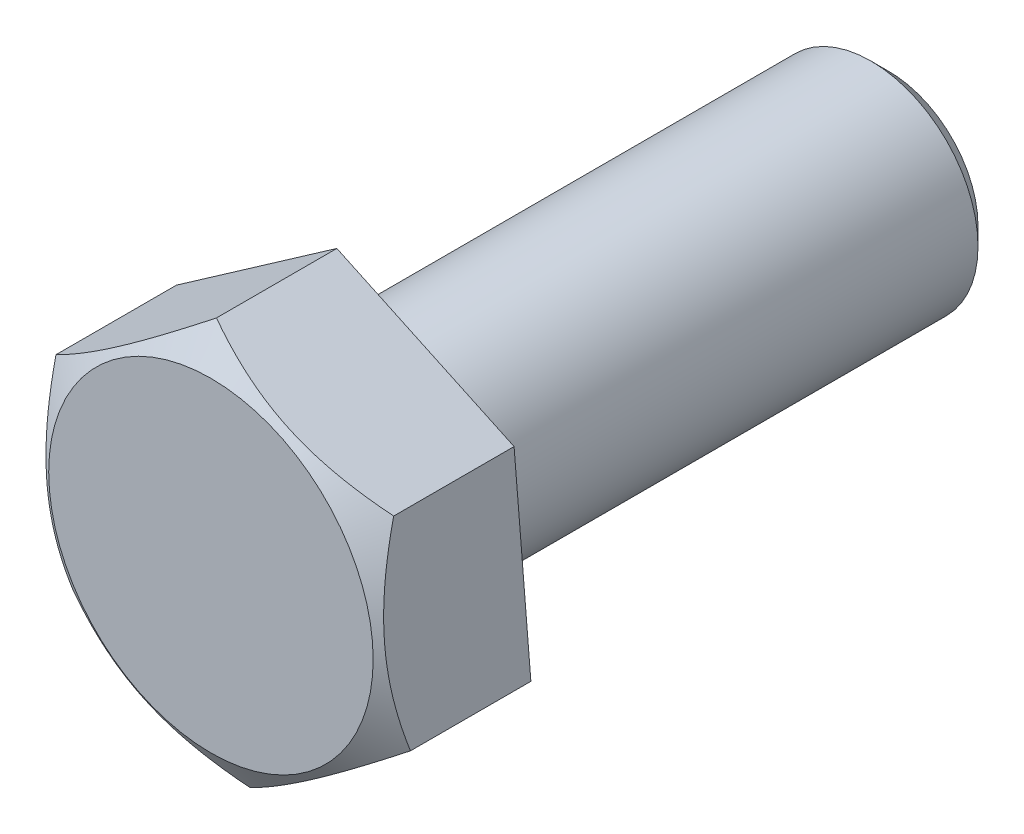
ISO-10303-21;
HEADER;
FILE_DESCRIPTION(('STEP AP214'),'2;1');
FILE_NAME('part.step','',(''),(''),'','','');
FILE_SCHEMA(('AUTOMOTIVE_DESIGN { 1 0 10303 214 1 1 1 1 }'));
ENDSEC;
DATA;
#1=APPLICATION_CONTEXT('core data for automotive mechanical design processes');
#2=APPLICATION_PROTOCOL_DEFINITION('international standard','automotive_design',2000,#1);
#3=PRODUCT_CONTEXT('',#1,'mechanical');
#4=PRODUCT('Part','Part','',(#3));
#5=PRODUCT_RELATED_PRODUCT_CATEGORY('part','',(#4));
#6=PRODUCT_DEFINITION_FORMATION('','',#4);
#7=PRODUCT_DEFINITION_CONTEXT('part definition',#1,'design');
#8=PRODUCT_DEFINITION('design','',#6,#7);
#9=PRODUCT_DEFINITION_SHAPE('','',#8);
#10=(LENGTH_UNIT() NAMED_UNIT(*) SI_UNIT(.MILLI.,.METRE.));
#11=(NAMED_UNIT(*) PLANE_ANGLE_UNIT() SI_UNIT($,.RADIAN.));
#12=(NAMED_UNIT(*) SI_UNIT($,.STERADIAN.) SOLID_ANGLE_UNIT());
#13=UNCERTAINTY_MEASURE_WITH_UNIT(LENGTH_MEASURE(1.E-05),#10,'distance_accuracy_value','');
#14=(GEOMETRIC_REPRESENTATION_CONTEXT(3) GLOBAL_UNCERTAINTY_ASSIGNED_CONTEXT((#13)) GLOBAL_UNIT_ASSIGNED_CONTEXT((#10,
#11,#12)) REPRESENTATION_CONTEXT('',''));
#15=CARTESIAN_POINT('',(0.,0.,0.));
#16=DIRECTION('',(0.,0.,1.));
#17=DIRECTION('',(1.,0.,0.));
#18=AXIS2_PLACEMENT_3D('',#15,#16,#17);
#19=CARTESIAN_POINT('',(-10.123708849,-10.123708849,9.491768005));
#20=DIRECTION('',(0.,0.,1.));
#21=DIRECTION('',(1.,0.,0.));
#22=AXIS2_PLACEMENT_3D('',#19,#20,#21);
#23=PLANE('',#22);
#24=CARTESIAN_POINT('',(0.,0.,9.491768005));
#25=DIRECTION('',(0.,0.,-1.));
#26=DIRECTION('',(-1.,0.,0.));
#27=AXIS2_PLACEMENT_3D('',#24,#25,#26);
#28=CIRCLE('',#27,10.00366487);
#29=CARTESIAN_POINT('',(-10.00366487,0.,9.491768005));
#30=VERTEX_POINT('',#29);
#31=EDGE_CURVE('E20',#30,#30,#28,.F.);
#32=ORIENTED_EDGE('',*,*,#31,.T.);
#33=EDGE_LOOP('',(#32));
#34=FACE_BOUND('',#33,.T.);
#35=ADVANCED_FACE('F16',(#34),#23,.T.);
#36=CARTESIAN_POINT('',(0.,0.,9.491768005));
#37=DIRECTION('',(0.,0.,-1.));
#38=DIRECTION('',(-1.,0.,0.));
#39=AXIS2_PLACEMENT_3D('',#36,#37,#38);
#40=CONICAL_SURFACE('',#39,10.00366487,0.98279372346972);
#41=ORIENTED_EDGE('',*,*,#31,.F.);
#42=EDGE_LOOP('',(#41));
#43=FACE_BOUND('',#42,.T.);
#44=CARTESIAN_POINT('',(-10.9291926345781,5.11430168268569,8.11646416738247));
#45=CARTESIAN_POINT('',(-10.8935082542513,4.70000005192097,8.25503939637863));
#46=CARTESIAN_POINT('',(-10.8575285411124,4.28226955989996,8.38409277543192));
#47=CARTESIAN_POINT('',(-10.7849371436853,3.43947128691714,8.61851598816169));
#48=CARTESIAN_POINT('',(-10.7483244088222,3.01439130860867,8.72384134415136));
#49=CARTESIAN_POINT('',(-10.674737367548,2.16003344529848,8.90517647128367));
#50=CARTESIAN_POINT('',(-10.6377656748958,1.7307859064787,8.98132590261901));
#51=CARTESIAN_POINT('',(-10.5820310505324,1.08369759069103,9.07070352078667));
#52=CARTESIAN_POINT('',(-10.5634108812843,0.867514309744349,9.09635199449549));
#53=CARTESIAN_POINT('',(-10.5260980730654,0.434306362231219,9.1389702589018));
#54=CARTESIAN_POINT('',(-10.5074054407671,0.217281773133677,9.15594083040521));
#55=CARTESIAN_POINT('',(-10.4694815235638,-0.223021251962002,9.18122370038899));
#56=CARTESIAN_POINT('',(-10.4502490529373,-0.446313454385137,9.18929545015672));
#57=CARTESIAN_POINT('',(-10.4117719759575,-0.89303875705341,9.19581348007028));
#58=CARTESIAN_POINT('',(-10.3925273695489,-1.11647185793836,9.19425971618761));
#59=CARTESIAN_POINT('',(-10.3540571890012,-1.56311709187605,9.1815533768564));
#60=CARTESIAN_POINT('',(-10.3348316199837,-1.78632916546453,9.17039868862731));
#61=CARTESIAN_POINT('',(-10.2964369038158,-2.23209824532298,9.13871206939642));
#62=CARTESIAN_POINT('',(-10.2772677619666,-2.45465519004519,9.1181792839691));
#63=CARTESIAN_POINT('',(-10.2198978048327,-3.12072999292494,9.04305431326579));
#64=CARTESIAN_POINT('',(-10.1818232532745,-3.56278190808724,8.97493145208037));
#65=CARTESIAN_POINT('',(-10.1062094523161,-4.44067079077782,8.80707769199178));
#66=CARTESIAN_POINT('',(-10.0686701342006,-4.87650855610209,8.70735088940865));
#67=CARTESIAN_POINT('',(-10.0082217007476,-5.57832498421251,8.5241205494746));
#68=CARTESIAN_POINT('',(-9.98512887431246,-5.84643656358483,8.44865959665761));
#69=CARTESIAN_POINT('',(-9.93922381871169,-6.37940194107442,8.2889025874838));
#70=CARTESIAN_POINT('',(-9.91641108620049,-6.64426158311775,8.20462622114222));
#71=CARTESIAN_POINT('',(-9.8937114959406,-6.90780762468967,8.11646416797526));
#72=B_SPLINE_CURVE_WITH_KNOTS('',3,(#44,#45,#46,#47,#48,#49,#50,#51,#52,#53,#54,#55,#56,#57,#58,
#59,#60,#61,#62,#63,#64,#65,#66,#67,#68,#69,#70,#71),.UNSPECIFIED.,.F.,.F.,(4,2,2,2,2,2,2,2,2,2,
2,2,2,4),(0.,1.31520920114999,2.63286359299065,3.94412935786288,4.59946746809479,
5.25474660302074,5.92733487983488,6.59992623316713,7.27266563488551,7.94546634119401,
9.29067706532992,10.6357135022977,11.4740206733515,12.3104938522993),.UNSPECIFIED.);
#73=CARTESIAN_POINT('',(-10.929192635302,5.11430168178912,8.11646416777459));
#74=VERTEX_POINT('',#73);
#75=CARTESIAN_POINT('',(-9.89371149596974,-6.90780762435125,8.11646416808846));
#76=VERTEX_POINT('',#75);
#77=EDGE_CURVE('E98',#74,#76,#72,.T.);
#78=ORIENTED_EDGE('',*,*,#77,.T.);
#79=CARTESIAN_POINT('',(-9.89371149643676,-6.90780762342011,8.11646416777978));
#80=CARTESIAN_POINT('',(-9.65010013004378,-7.02180525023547,8.20610787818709));
#81=CARTESIAN_POINT('',(-9.40523483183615,-7.136389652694,8.29173940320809));
#82=CARTESIAN_POINT('',(-8.91284732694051,-7.36680175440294,8.45375679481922));
#83=CARTESIAN_POINT('',(-8.6653235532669,-7.48263018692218,8.53013684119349));
#84=CARTESIAN_POINT('',(-8.16694280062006,-7.71584682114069,8.67255239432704));
#85=CARTESIAN_POINT('',(-7.91607744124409,-7.83323894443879,8.73855244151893));
#86=CARTESIAN_POINT('',(-7.41206050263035,-8.06909302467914,8.85853060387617));
#87=CARTESIAN_POINT('',(-7.15890961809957,-8.18755465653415,8.91251225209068));
#88=CARTESIAN_POINT('',(-6.6589231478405,-8.42152268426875,9.00563490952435));
#89=CARTESIAN_POINT('',(-6.41215364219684,-8.53699815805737,9.04520557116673));
#90=CARTESIAN_POINT('',(-5.91713280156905,-8.76864252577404,9.11091887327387));
#91=CARTESIAN_POINT('',(-5.66888142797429,-8.88481143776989,9.13706116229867));
#92=CARTESIAN_POINT('',(-5.1719115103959,-9.11736787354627,9.17515425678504));
#93=CARTESIAN_POINT('',(-4.92319451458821,-9.23375467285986,9.18712950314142));
#94=CARTESIAN_POINT('',(-4.42554035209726,-9.46663130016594,9.19661628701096));
#95=CARTESIAN_POINT('',(-4.17660319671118,-9.58312112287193,9.19412852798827));
#96=CARTESIAN_POINT('',(-3.71964626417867,-9.79695353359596,9.17634575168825));
#97=CARTESIAN_POINT('',(-3.51155503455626,-9.89432955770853,9.16319900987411));
#98=CARTESIAN_POINT('',(-3.09605530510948,-10.0887621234,9.12709269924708));
#99=CARTESIAN_POINT('',(-2.88864686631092,-10.1858186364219,9.10413227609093));
#100=CARTESIAN_POINT('',(-2.47462828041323,-10.3795581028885,9.0488089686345));
#101=CARTESIAN_POINT('',(-2.26801930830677,-10.4762405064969,9.01643542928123));
#102=CARTESIAN_POINT('',(-1.85608298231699,-10.6690055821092,8.94287475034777));
#103=CARTESIAN_POINT('',(-1.65075574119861,-10.7650882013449,8.90168684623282));
#104=CARTESIAN_POINT('',(-1.02530109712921,-11.0577689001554,8.76330605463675));
#105=CARTESIAN_POINT('',(-0.607563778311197,-11.2532485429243,8.65293760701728));
#106=CARTESIAN_POINT('',(0.219860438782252,-11.6404406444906,8.40417035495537));
#107=CARTESIAN_POINT('',(0.629565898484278,-11.8321617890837,8.26584739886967));
#108=CARTESIAN_POINT('',(1.03548113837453,-12.0221093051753,8.11646416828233));
#109=B_SPLINE_CURVE_WITH_KNOTS('',3,(#79,#80,#81,#82,#83,#84,#85,#86,#87,#88,#89,#90,#91,#92,
#93,#94,#95,#96,#97,#98,#99,#100,#101,#102,#103,#104,#105,#106,#107,#108),.UNSPECIFIED.,.F.,.F.,
(4,2,2,2,2,2,2,2,2,2,2,2,2,2,4),(0.,0.850565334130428,1.70166302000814,2.55560782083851,
3.40930125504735,4.23492135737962,5.06056306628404,5.88477829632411,6.70895343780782,
7.39911515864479,8.08933697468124,8.78034314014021,9.47140926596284,10.8930337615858,
12.3108515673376),.UNSPECIFIED.);
#110=CARTESIAN_POINT('',(1.0354811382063,-12.0221093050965,8.11646416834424));
#111=VERTEX_POINT('',#110);
#112=EDGE_CURVE('E82',#76,#111,#109,.T.);
#113=ORIENTED_EDGE('',*,*,#112,.T.);
#114=CARTESIAN_POINT('',(1.03548113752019,-12.0221093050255,8.11646416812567));
#115=CARTESIAN_POINT('',(1.256011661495,-11.8681344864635,8.20610787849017));
#116=CARTESIAN_POINT('',(1.47767731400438,-11.7133671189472,8.29173940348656));
#117=CARTESIAN_POINT('',(1.92341379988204,-11.4021530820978,8.45375679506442));
#118=CARTESIAN_POINT('',(2.14748605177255,-11.2457054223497,8.53013684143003));
#119=CARTESIAN_POINT('',(2.59864795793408,-10.9307033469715,8.67255239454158));
#120=CARTESIAN_POINT('',(2.82574519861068,-10.772143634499,8.7385524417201));
#121=CARTESIAN_POINT('',(3.28200929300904,-10.4535792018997,8.85853060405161));
#122=CARTESIAN_POINT('',(3.5111755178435,-10.293574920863,8.91251225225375));
#123=CARTESIAN_POINT('',(3.96379100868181,-9.97755794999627,9.00563490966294));
#124=CARTESIAN_POINT('',(4.18718045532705,-9.82158702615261,9.04520557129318));
#125=CARTESIAN_POINT('',(4.63530078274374,-9.50870858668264,9.11091887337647));
#126=CARTESIAN_POINT('',(4.86003169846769,-9.35180104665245,9.13706116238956));
#127=CARTESIAN_POINT('',(5.30991643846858,-9.03769069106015,9.17515425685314));
#128=CARTESIAN_POINT('',(5.53506886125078,-8.88048885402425,9.18712950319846));
#129=CARTESIAN_POINT('',(5.98557301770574,-8.56594602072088,9.19661628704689));
#130=CARTESIAN_POINT('',(6.21092474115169,-8.40860503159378,9.19412852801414));
#131=CARTESIAN_POINT('',(6.62458750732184,-8.11978492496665,9.17634575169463));
#132=CARTESIAN_POINT('',(6.8129632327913,-7.98826064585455,9.16319900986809));
#133=CARTESIAN_POINT('',(7.18909663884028,-7.72564360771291,9.127092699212));
#134=CARTESIAN_POINT('',(7.37685426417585,-7.59455088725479,9.10413227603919));
#135=CARTESIAN_POINT('',(7.75164685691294,-7.33287000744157,9.04880896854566));
#136=CARTESIAN_POINT('',(7.93868076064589,-7.20228259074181,9.01643542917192));
#137=CARTESIAN_POINT('',(8.31158837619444,-6.94191780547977,8.94287475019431));
#138=CARTESIAN_POINT('',(8.49746198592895,-6.81214050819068,8.90168684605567));
#139=CARTESIAN_POINT('',(9.06365822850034,-6.41682124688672,8.76330605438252));
#140=CARTESIAN_POINT('',(9.44181722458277,-6.15278993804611,8.65293760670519));
#141=CARTESIAN_POINT('',(10.1908475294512,-5.62981559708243,8.40417035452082));
#142=CARTESIAN_POINT('',(10.5617356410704,-5.37086083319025,8.26584739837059));
#143=CARTESIAN_POINT('',(10.9291926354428,-5.11430168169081,8.11646416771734));
#144=B_SPLINE_CURVE_WITH_KNOTS('',3,(#114,#115,#116,#117,#118,#119,#120,#121,#122,#123,#124,
#125,#126,#127,#128,#129,#130,#131,#132,#133,#134,#135,#136,#137,#138,#139,#140,#141,#142,#143),
.UNSPECIFIED.,.F.,.F.,(4,2,2,2,2,2,2,2,2,2,2,2,2,2,4),(0.,0.850565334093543,1.70166301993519,
2.55560782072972,3.4093012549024,4.234921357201,5.06056306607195,5.88477829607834,
6.70895343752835,7.39911515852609,8.08933697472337,8.78034314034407,9.47140926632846,
10.8930337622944,12.310851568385),.UNSPECIFIED.);
#145=CARTESIAN_POINT('',(10.9291926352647,-5.11430168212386,8.11646416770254));
#146=VERTEX_POINT('',#145);
#147=EDGE_CURVE('E79',#111,#146,#144,.T.);
#148=ORIENTED_EDGE('',*,*,#147,.T.);
#149=CARTESIAN_POINT('',(10.9291926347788,-5.1143016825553,8.11646416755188));
#150=CARTESIAN_POINT('',(10.8935082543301,-4.70000005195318,8.25503939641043));
#151=CARTESIAN_POINT('',(10.8575285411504,-4.28226956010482,8.38409277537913));
#152=CARTESIAN_POINT('',(10.7849371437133,-3.43947128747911,8.6185159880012));
#153=CARTESIAN_POINT('',(10.7483244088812,-3.01439130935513,8.72384134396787));
#154=CARTESIAN_POINT('',(10.674737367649,-2.16003344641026,8.90517647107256));
#155=CARTESIAN_POINT('',(10.6377656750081,-1.73078590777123,8.9813259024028));
#156=CARTESIAN_POINT('',(10.5820310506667,-1.08369759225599,9.0707035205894));
#157=CARTESIAN_POINT('',(10.5634108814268,-0.867514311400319,9.09635199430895));
#158=CARTESIAN_POINT('',(10.5260980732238,-0.434306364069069,9.1389702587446));
#159=CARTESIAN_POINT('',(10.5074054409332,-0.217281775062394,9.15594083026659));
#160=CARTESIAN_POINT('',(10.4694815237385,0.223021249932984,9.18122370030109));
#161=CARTESIAN_POINT('',(10.4502490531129,0.446313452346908,9.18929545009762));
#162=CARTESIAN_POINT('',(10.4117719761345,0.893038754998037,9.19581348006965));
#163=CARTESIAN_POINT('',(10.3925273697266,1.11647185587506,9.19425971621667));
#164=CARTESIAN_POINT('',(10.3540571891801,1.56311708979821,9.18155337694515));
#165=CARTESIAN_POINT('',(10.3348316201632,1.78632916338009,9.17039868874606));
#166=CARTESIAN_POINT('',(10.2964369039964,2.23209824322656,9.1387120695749));
#167=CARTESIAN_POINT('',(10.2772677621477,2.45465518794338,9.11817928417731));
#168=CARTESIAN_POINT('',(10.219897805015,3.1207299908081,9.04305431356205));
#169=CARTESIAN_POINT('',(10.1818232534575,3.56278190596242,8.97493145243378));
#170=CARTESIAN_POINT('',(10.1062094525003,4.44067078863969,8.80707769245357));
#171=CARTESIAN_POINT('',(10.0686701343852,4.87650855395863,8.70735088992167));
#172=CARTESIAN_POINT('',(10.0082217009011,5.57832498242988,8.52412054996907));
#173=CARTESIAN_POINT('',(9.98512887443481,5.8464365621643,8.4486595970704));
#174=CARTESIAN_POINT('',(9.93922381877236,6.37940194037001,8.28890258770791));
#175=CARTESIAN_POINT('',(9.91641108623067,6.64426158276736,8.20462622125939));
#176=CARTESIAN_POINT('',(9.8937114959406,6.90780762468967,8.11646416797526));
#177=B_SPLINE_CURVE_WITH_KNOTS('',3,(#149,#150,#151,#152,#153,#154,#155,#156,#157,#158,#159,
#160,#161,#162,#163,#164,#165,#166,#167,#168,#169,#170,#171,#172,#173,#174,#175,#176),
.UNSPECIFIED.,.F.,.F.,(4,2,2,2,2,2,2,2,2,2,2,2,2,4),(0.,1.3152092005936,2.63286359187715,
3.94412935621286,4.59946746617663,5.25474660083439,5.92733487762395,6.59992623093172,
7.27266563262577,7.94546633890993,9.29067706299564,10.6357134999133,11.4740206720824,
12.3104938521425),.UNSPECIFIED.);
#178=CARTESIAN_POINT('',(9.89371149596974,6.90780762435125,8.11646416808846));
#179=VERTEX_POINT('',#178);
#180=EDGE_CURVE('E68',#146,#179,#177,.T.);
#181=ORIENTED_EDGE('',*,*,#180,.T.);
#182=CARTESIAN_POINT('',(9.89371149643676,6.90780762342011,8.11646416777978));
#183=CARTESIAN_POINT('',(9.65010013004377,7.02180525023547,8.20610787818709));
#184=CARTESIAN_POINT('',(9.40523483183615,7.136389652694,8.29173940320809));
#185=CARTESIAN_POINT('',(8.91284732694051,7.36680175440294,8.45375679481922));
#186=CARTESIAN_POINT('',(8.6653235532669,7.48263018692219,8.53013684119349));
#187=CARTESIAN_POINT('',(8.16694280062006,7.71584682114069,8.67255239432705));
#188=CARTESIAN_POINT('',(7.91607744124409,7.83323894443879,8.73855244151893));
#189=CARTESIAN_POINT('',(7.41206050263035,8.06909302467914,8.85853060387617));
#190=CARTESIAN_POINT('',(7.15890961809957,8.18755465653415,8.91251225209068));
#191=CARTESIAN_POINT('',(6.6589231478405,8.42152268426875,9.00563490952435));
#192=CARTESIAN_POINT('',(6.41215364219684,8.53699815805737,9.04520557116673));
#193=CARTESIAN_POINT('',(5.91713280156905,8.76864252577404,9.11091887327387));
#194=CARTESIAN_POINT('',(5.66888142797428,8.88481143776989,9.13706116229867));
#195=CARTESIAN_POINT('',(5.1719115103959,9.11736787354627,9.17515425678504));
#196=CARTESIAN_POINT('',(4.9231945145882,9.23375467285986,9.18712950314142));
#197=CARTESIAN_POINT('',(4.42554035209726,9.46663130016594,9.19661628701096));
#198=CARTESIAN_POINT('',(4.17660319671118,9.58312112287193,9.19412852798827));
#199=CARTESIAN_POINT('',(3.71964626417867,9.79695353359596,9.17634575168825));
#200=CARTESIAN_POINT('',(3.51155503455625,9.89432955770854,9.16319900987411));
#201=CARTESIAN_POINT('',(3.09605530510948,10.0887621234,9.12709269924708));
#202=CARTESIAN_POINT('',(2.88864686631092,10.1858186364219,9.10413227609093));
#203=CARTESIAN_POINT('',(2.47462828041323,10.3795581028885,9.0488089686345));
#204=CARTESIAN_POINT('',(2.26801930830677,10.4762405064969,9.01643542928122));
#205=CARTESIAN_POINT('',(1.85608298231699,10.6690055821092,8.94287475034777));
#206=CARTESIAN_POINT('',(1.65075574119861,10.7650882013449,8.90168684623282));
#207=CARTESIAN_POINT('',(1.02530109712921,11.0577689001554,8.76330605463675));
#208=CARTESIAN_POINT('',(0.607563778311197,11.2532485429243,8.65293760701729));
#209=CARTESIAN_POINT('',(-0.219860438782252,11.6404406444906,8.40417035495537));
#210=CARTESIAN_POINT('',(-0.629565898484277,11.8321617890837,8.26584739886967));
#211=CARTESIAN_POINT('',(-1.03548113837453,12.0221093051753,8.11646416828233));
#212=B_SPLINE_CURVE_WITH_KNOTS('',3,(#182,#183,#184,#185,#186,#187,#188,#189,#190,#191,#192,
#193,#194,#195,#196,#197,#198,#199,#200,#201,#202,#203,#204,#205,#206,#207,#208,#209,#210,#211),
.UNSPECIFIED.,.F.,.F.,(4,2,2,2,2,2,2,2,2,2,2,2,2,2,4),(0.,0.850565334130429,1.70166302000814,
2.55560782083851,3.40930125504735,4.23492135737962,5.06056306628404,5.88477829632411,
6.70895343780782,7.39911515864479,8.08933697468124,8.78034314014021,9.47140926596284,
10.8930337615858,12.3108515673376),.UNSPECIFIED.);
#213=CARTESIAN_POINT('',(-1.0354811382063,12.0221093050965,8.11646416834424));
#214=VERTEX_POINT('',#213);
#215=EDGE_CURVE('E106',#179,#214,#212,.T.);
#216=ORIENTED_EDGE('',*,*,#215,.T.);
#217=CARTESIAN_POINT('',(-1.03548113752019,12.0221093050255,8.11646416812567));
#218=CARTESIAN_POINT('',(-1.25601166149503,11.8681344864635,8.20610787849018));
#219=CARTESIAN_POINT('',(-1.47767731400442,11.7133671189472,8.29173940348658));
#220=CARTESIAN_POINT('',(-1.92341379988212,11.4021530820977,8.45375679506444));
#221=CARTESIAN_POINT('',(-2.14748605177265,11.2457054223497,8.53013684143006));
#222=CARTESIAN_POINT('',(-2.59864795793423,10.9307033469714,8.67255239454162));
#223=CARTESIAN_POINT('',(-2.82574519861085,10.7721436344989,8.73855244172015));
#224=CARTESIAN_POINT('',(-3.28200929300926,10.4535792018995,8.85853060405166));
#225=CARTESIAN_POINT('',(-3.51117551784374,10.2935749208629,8.9125122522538));
#226=CARTESIAN_POINT('',(-3.96379100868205,9.9775579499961,9.00563490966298));
#227=CARTESIAN_POINT('',(-4.18718045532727,9.82158702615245,9.04520557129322));
#228=CARTESIAN_POINT('',(-4.63530078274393,9.50870858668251,9.1109188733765));
#229=CARTESIAN_POINT('',(-4.86003169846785,9.35180104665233,9.13706116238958));
#230=CARTESIAN_POINT('',(-5.3099164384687,9.03769069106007,9.17515425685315));
#231=CARTESIAN_POINT('',(-5.53506886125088,8.88048885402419,9.18712950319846));
#232=CARTESIAN_POINT('',(-5.98557301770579,8.56594602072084,9.19661628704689));
#233=CARTESIAN_POINT('',(-6.21092474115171,8.40860503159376,9.19412852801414));
#234=CARTESIAN_POINT('',(-6.62458750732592,8.1197849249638,9.17634575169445));
#235=CARTESIAN_POINT('',(-6.81296323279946,7.98826064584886,9.16319900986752));
#236=CARTESIAN_POINT('',(-7.18909663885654,7.72564360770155,9.12709269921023));
#237=CARTESIAN_POINT('',(-7.37685426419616,7.59455088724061,9.10413227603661));
#238=CARTESIAN_POINT('',(-7.75164685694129,7.33287000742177,9.04880896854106));
#239=CARTESIAN_POINT('',(-7.93868076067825,7.20228259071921,9.01643542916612));
#240=CARTESIAN_POINT('',(-8.31158837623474,6.94191780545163,8.94287475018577));
#241=CARTESIAN_POINT('',(-8.4974619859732,6.81214050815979,8.90168684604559));
#242=CARTESIAN_POINT('',(-9.06365822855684,6.41682124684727,8.7633060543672));
#243=CARTESIAN_POINT('',(-9.44181722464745,6.15278993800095,8.65293760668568));
#244=CARTESIAN_POINT('',(-10.1908475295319,5.6298155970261,8.40417035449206));
#245=CARTESIAN_POINT('',(-10.5617356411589,5.37086083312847,8.26584739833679));
#246=CARTESIAN_POINT('',(-10.929192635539,5.11430168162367,8.11646416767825));
#247=B_SPLINE_CURVE_WITH_KNOTS('',3,(#217,#218,#219,#220,#221,#222,#223,#224,#225,#226,#227,
#228,#229,#230,#231,#232,#233,#234,#235,#236,#237,#238,#239,#240,#241,#242,#243,#244,#245,#246),
.UNSPECIFIED.,.F.,.F.,(4,2,2,2,2,2,2,2,2,2,2,2,2,2,4),(0.,0.850565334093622,1.70166301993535,
2.55560782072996,3.40930125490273,4.23492135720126,5.06056306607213,5.88477829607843,
6.70895343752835,7.39911515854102,8.08933697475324,8.78034314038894,9.47140926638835,
10.8930337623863,12.3108515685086),.UNSPECIFIED.);
#248=EDGE_CURVE('E102',#214,#74,#247,.T.);
#249=ORIENTED_EDGE('',*,*,#248,.T.);
#250=EDGE_LOOP('',(#78,#113,#148,#181,#216,#249));
#251=FACE_BOUND('',#250,.T.);
#252=ADVANCED_FACE('F80',(#43,#251),#40,.T.);
#253=CARTESIAN_POINT('',(9.893711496,6.907807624,0.691768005));
#254=DIRECTION('',(-0.996311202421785,-0.0858136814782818,0.));
#255=DIRECTION('',(0.0858136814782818,-0.996311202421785,0.));
#256=AXIS2_PLACEMENT_3D('',#253,#254,#255);
#257=PLANE('',#256);
#258=DIRECTION('',(0.,0.,-1.));
#259=VECTOR('',#258,1.);
#260=CARTESIAN_POINT('',(10.929192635,-5.114301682,5.0029914));
#261=LINE('',#260,#259);
#262=CARTESIAN_POINT('',(10.929192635,-5.114301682,0.691768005));
#263=VERTEX_POINT('',#262);
#264=EDGE_CURVE('E72',#146,#263,#261,.T.);
#265=ORIENTED_EDGE('',*,*,#264,.T.);
#266=DIRECTION('',(0.0858136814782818,-0.996311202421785,0.));
#267=VECTOR('',#266,1.);
#268=CARTESIAN_POINT('',(9.893711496,6.907807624,0.691768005));
#269=LINE('',#268,#267);
#270=CARTESIAN_POINT('',(9.893711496,6.907807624,0.691768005));
#271=VERTEX_POINT('',#270);
#272=EDGE_CURVE('E84',#263,#271,#269,.F.);
#273=ORIENTED_EDGE('',*,*,#272,.T.);
#274=DIRECTION('',(0.,0.,1.));
#275=VECTOR('',#274,1.);
#276=CARTESIAN_POINT('',(9.893711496,6.907807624,5.0029925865));
#277=LINE('',#276,#275);
#278=EDGE_CURVE('E75',#271,#179,#277,.T.);
#279=ORIENTED_EDGE('',*,*,#278,.T.);
#280=ORIENTED_EDGE('',*,*,#180,.F.);
#281=EDGE_LOOP('',(#265,#273,#279,#280));
#282=FACE_BOUND('',#281,.T.);
#283=ADVANCED_FACE('F70',(#282),#257,.F.);
#284=CARTESIAN_POINT('',(-1.035481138,12.022109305,0.691768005));
#285=DIRECTION('',(-0.423838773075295,-0.905737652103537,0.));
#286=DIRECTION('',(0.905737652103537,-0.423838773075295,0.));
#287=AXIS2_PLACEMENT_3D('',#284,#285,#286);
#288=PLANE('',#287);
#289=ORIENTED_EDGE('',*,*,#278,.F.);
#290=DIRECTION('',(0.905737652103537,-0.423838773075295,0.));
#291=VECTOR('',#290,1.);
#292=CARTESIAN_POINT('',(-1.035481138,12.022109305,0.691768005));
#293=LINE('',#292,#291);
#294=CARTESIAN_POINT('',(-1.035481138,12.022109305,0.691768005));
#295=VERTEX_POINT('',#294);
#296=EDGE_CURVE('E119',#271,#295,#293,.F.);
#297=ORIENTED_EDGE('',*,*,#296,.T.);
#298=DIRECTION('',(0.,0.,1.));
#299=VECTOR('',#298,1.);
#300=CARTESIAN_POINT('',(-1.035481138,12.022109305,5.0029914));
#301=LINE('',#300,#299);
#302=EDGE_CURVE('E103',#295,#214,#301,.T.);
#303=ORIENTED_EDGE('',*,*,#302,.T.);
#304=ORIENTED_EDGE('',*,*,#215,.F.);
#305=EDGE_LOOP('',(#289,#297,#303,#304));
#306=FACE_BOUND('',#305,.T.);
#307=ADVANCED_FACE('F165',(#306),#288,.F.);
#308=CARTESIAN_POINT('',(-10.929192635,5.114301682,0.691768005));
#309=DIRECTION('',(0.572472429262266,-0.819923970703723,0.));
#310=DIRECTION('',(0.819923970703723,0.572472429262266,0.));
#311=AXIS2_PLACEMENT_3D('',#308,#309,#310);
#312=PLANE('',#311);
#313=ORIENTED_EDGE('',*,*,#302,.F.);
#314=DIRECTION('',(0.819923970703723,0.572472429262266,0.));
#315=VECTOR('',#314,1.);
#316=CARTESIAN_POINT('',(-10.929192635,5.114301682,0.691768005));
#317=LINE('',#316,#315);
#318=CARTESIAN_POINT('',(-10.929192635,5.114301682,0.691768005));
#319=VERTEX_POINT('',#318);
#320=EDGE_CURVE('E117',#295,#319,#317,.F.);
#321=ORIENTED_EDGE('',*,*,#320,.T.);
#322=DIRECTION('',(0.,0.,1.));
#323=VECTOR('',#322,1.);
#324=CARTESIAN_POINT('',(-10.929192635,5.114301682,5.0029936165));
#325=LINE('',#324,#323);
#326=EDGE_CURVE('E99',#319,#74,#325,.T.);
#327=ORIENTED_EDGE('',*,*,#326,.T.);
#328=ORIENTED_EDGE('',*,*,#248,.F.);
#329=EDGE_LOOP('',(#313,#321,#327,#328));
#330=FACE_BOUND('',#329,.T.);
#331=ADVANCED_FACE('F184',(#330),#312,.F.);
#332=CARTESIAN_POINT('',(-9.893711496,-6.907807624,0.691768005));
#333=DIRECTION('',(0.996311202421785,0.0858136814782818,0.));
#334=DIRECTION('',(-0.0858136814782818,0.996311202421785,0.));
#335=AXIS2_PLACEMENT_3D('',#332,#333,#334);
#336=PLANE('',#335);
#337=ORIENTED_EDGE('',*,*,#326,.F.);
#338=DIRECTION('',(-0.0858136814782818,0.996311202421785,0.));
#339=VECTOR('',#338,1.);
#340=CARTESIAN_POINT('',(-9.893711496,-6.907807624,0.691768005));
#341=LINE('',#340,#339);
#342=CARTESIAN_POINT('',(-9.893711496,-6.907807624,0.691768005));
#343=VERTEX_POINT('',#342);
#344=EDGE_CURVE('E115',#319,#343,#341,.F.);
#345=ORIENTED_EDGE('',*,*,#344,.T.);
#346=DIRECTION('',(0.,0.,1.));
#347=VECTOR('',#346,1.);
#348=CARTESIAN_POINT('',(-9.893711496,-6.907807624,5.0029925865));
#349=LINE('',#348,#347);
#350=EDGE_CURVE('E93',#343,#76,#349,.T.);
#351=ORIENTED_EDGE('',*,*,#350,.T.);
#352=ORIENTED_EDGE('',*,*,#77,.F.);
#353=EDGE_LOOP('',(#337,#345,#351,#352));
#354=FACE_BOUND('',#353,.T.);
#355=ADVANCED_FACE('F188',(#354),#336,.F.);
#356=CARTESIAN_POINT('',(1.035481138,-12.022109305,0.691768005));
#357=DIRECTION('',(0.423838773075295,0.905737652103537,0.));
#358=DIRECTION('',(-0.905737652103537,0.423838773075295,0.));
#359=AXIS2_PLACEMENT_3D('',#356,#357,#358);
#360=PLANE('',#359);
#361=ORIENTED_EDGE('',*,*,#350,.F.);
#362=DIRECTION('',(-0.905737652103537,0.423838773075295,0.));
#363=VECTOR('',#362,1.);
#364=CARTESIAN_POINT('',(1.035481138,-12.022109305,0.691768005));
#365=LINE('',#364,#363);
#366=CARTESIAN_POINT('',(1.035481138,-12.022109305,0.691768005));
#367=VERTEX_POINT('',#366);
#368=EDGE_CURVE('E35',#343,#367,#365,.F.);
#369=ORIENTED_EDGE('',*,*,#368,.T.);
#370=DIRECTION('',(0.,0.,1.));
#371=VECTOR('',#370,1.);
#372=CARTESIAN_POINT('',(1.035481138,-12.022109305,5.0029914));
#373=LINE('',#372,#371);
#374=EDGE_CURVE('E85',#367,#111,#373,.T.);
#375=ORIENTED_EDGE('',*,*,#374,.T.);
#376=ORIENTED_EDGE('',*,*,#112,.F.);
#377=EDGE_LOOP('',(#361,#369,#375,#376));
#378=FACE_BOUND('',#377,.T.);
#379=ADVANCED_FACE('F137',(#378),#360,.F.);
#380=CARTESIAN_POINT('',(10.929192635,-5.114301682,0.691768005));
#381=DIRECTION('',(-0.572472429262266,0.819923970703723,0.));
#382=DIRECTION('',(-0.819923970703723,-0.572472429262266,0.));
#383=AXIS2_PLACEMENT_3D('',#380,#381,#382);
#384=PLANE('',#383);
#385=ORIENTED_EDGE('',*,*,#374,.F.);
#386=DIRECTION('',(-0.819923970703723,-0.572472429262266,0.));
#387=VECTOR('',#386,1.);
#388=CARTESIAN_POINT('',(10.929192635,-5.114301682,0.691768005));
#389=LINE('',#388,#387);
#390=EDGE_CURVE('E89',#367,#263,#389,.F.);
#391=ORIENTED_EDGE('',*,*,#390,.T.);
#392=ORIENTED_EDGE('',*,*,#264,.F.);
#393=ORIENTED_EDGE('',*,*,#147,.F.);
#394=EDGE_LOOP('',(#385,#391,#392,#393));
#395=FACE_BOUND('',#394,.T.);
#396=ADVANCED_FACE('F87',(#395),#384,.F.);
#397=CARTESIAN_POINT('',(5.566,-5.566,-32.308231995));
#398=DIRECTION('',(0.,0.,-1.));
#399=DIRECTION('',(-1.,0.,0.));
#400=AXIS2_PLACEMENT_3D('',#397,#398,#399);
#401=PLANE('',#400);
#402=CARTESIAN_POINT('',(0.,0.,-32.308231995));
#403=DIRECTION('',(0.,0.,1.));
#404=DIRECTION('',(1.,0.,0.));
#405=AXIS2_PLACEMENT_3D('',#402,#403,#404);
#406=CIRCLE('',#405,5.50000000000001);
#407=CARTESIAN_POINT('',(5.50000000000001,0.,-32.308231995));
#408=VERTEX_POINT('',#407);
#409=EDGE_CURVE('E110',#408,#408,#406,.F.);
#410=ORIENTED_EDGE('',*,*,#409,.T.);
#411=EDGE_LOOP('',(#410));
#412=FACE_BOUND('',#411,.T.);
#413=ADVANCED_FACE('F136',(#412),#401,.T.);
#414=CARTESIAN_POINT('',(-11.060342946,-12.166374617,0.691768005));
#415=DIRECTION('',(0.,0.,1.));
#416=DIRECTION('',(1.,0.,0.));
#417=AXIS2_PLACEMENT_3D('',#414,#415,#416);
#418=PLANE('',#417);
#419=CARTESIAN_POINT('',(0.,0.,0.691768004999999));
#420=DIRECTION('',(0.,0.,1.));
#421=DIRECTION('',(0.,-1.,0.));
#422=AXIS2_PLACEMENT_3D('',#419,#420,#421);
#423=CIRCLE('',#422,6.6);
#424=CARTESIAN_POINT('',(0.,-6.60000000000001,0.691768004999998));
#425=VERTEX_POINT('',#424);
#426=EDGE_CURVE('E26',#425,#425,#423,.T.);
#427=ORIENTED_EDGE('',*,*,#426,.T.);
#428=EDGE_LOOP('',(#427));
#429=FACE_BOUND('',#428,.T.);
#430=ORIENTED_EDGE('',*,*,#368,.F.);
#431=ORIENTED_EDGE('',*,*,#344,.F.);
#432=ORIENTED_EDGE('',*,*,#320,.F.);
#433=ORIENTED_EDGE('',*,*,#296,.F.);
#434=ORIENTED_EDGE('',*,*,#272,.F.);
#435=ORIENTED_EDGE('',*,*,#390,.F.);
#436=EDGE_LOOP('',(#430,#431,#432,#433,#434,#435));
#437=FACE_BOUND('',#436,.T.);
#438=ADVANCED_FACE('F18',(#429,#437),#418,.F.);
#439=CARTESIAN_POINT('',(0.,0.,-32.308231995));
#440=DIRECTION('',(0.,0.,1.));
#441=DIRECTION('',(1.,0.,0.));
#442=AXIS2_PLACEMENT_3D('',#439,#440,#441);
#443=CONICAL_SURFACE('',#442,5.5,0.785398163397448);
#444=ORIENTED_EDGE('',*,*,#409,.F.);
#445=EDGE_LOOP('',(#444));
#446=FACE_BOUND('',#445,.T.);
#447=CARTESIAN_POINT('',(0.,0.,-31.208231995));
#448=DIRECTION('',(0.,0.,1.));
#449=DIRECTION('',(1.,0.,0.));
#450=AXIS2_PLACEMENT_3D('',#447,#448,#449);
#451=CIRCLE('',#450,6.6);
#452=CARTESIAN_POINT('',(6.6,0.,-31.208231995));
#453=VERTEX_POINT('',#452);
#454=EDGE_CURVE('E11',#453,#453,#451,.F.);
#455=ORIENTED_EDGE('',*,*,#454,.T.);
#456=EDGE_LOOP('',(#455));
#457=FACE_BOUND('',#456,.T.);
#458=ADVANCED_FACE('F146',(#446,#457),#443,.T.);
#459=CARTESIAN_POINT('',(0.,0.,-31.208231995));
#460=DIRECTION('',(0.,0.,1.));
#461=DIRECTION('',(0.,-1.,0.));
#462=AXIS2_PLACEMENT_3D('',#459,#460,#461);
#463=CYLINDRICAL_SURFACE('',#462,6.6);
#464=ORIENTED_EDGE('',*,*,#426,.F.);
#465=EDGE_LOOP('',(#464));
#466=FACE_BOUND('',#465,.T.);
#467=ORIENTED_EDGE('',*,*,#454,.F.);
#468=EDGE_LOOP('',(#467));
#469=FACE_BOUND('',#468,.T.);
#470=ADVANCED_FACE('F148',(#466,#469),#463,.T.);
#471=CLOSED_SHELL('',(#35,#252,#283,#307,#331,#355,#379,#396,#413,#438,#458,#470));
#472=MANIFOLD_SOLID_BREP('B1',#471);
#473=ADVANCED_BREP_SHAPE_REPRESENTATION('',(#18,#472),#14);
#474=SHAPE_DEFINITION_REPRESENTATION(#9,#473);
ENDSEC;
END-ISO-10303-21;
